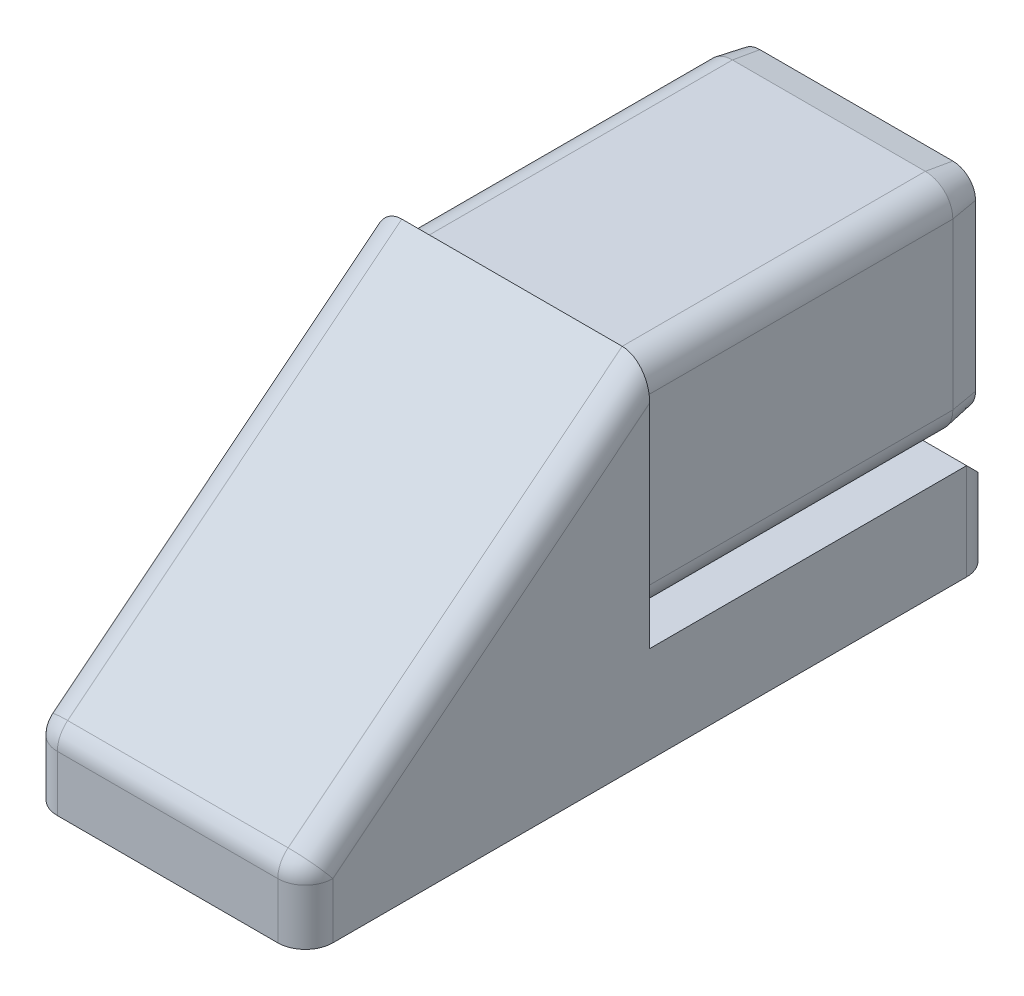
ISO-10303-21;
HEADER;
FILE_DESCRIPTION(('STEP AP214'),'2;1');
FILE_NAME('part.step','',(''),(''),'','','');
FILE_SCHEMA(('AUTOMOTIVE_DESIGN { 1 0 10303 214 1 1 1 1 }'));
ENDSEC;
DATA;
#1=APPLICATION_CONTEXT('core data for automotive mechanical design processes');
#2=APPLICATION_PROTOCOL_DEFINITION('international standard','automotive_design',2000,#1);
#3=PRODUCT_CONTEXT('',#1,'mechanical');
#4=PRODUCT('Part','Part','',(#3));
#5=PRODUCT_RELATED_PRODUCT_CATEGORY('part','',(#4));
#6=PRODUCT_DEFINITION_FORMATION('','',#4);
#7=PRODUCT_DEFINITION_CONTEXT('part definition',#1,'design');
#8=PRODUCT_DEFINITION('design','',#6,#7);
#9=PRODUCT_DEFINITION_SHAPE('','',#8);
#10=(LENGTH_UNIT() NAMED_UNIT(*) SI_UNIT(.MILLI.,.METRE.));
#11=(NAMED_UNIT(*) PLANE_ANGLE_UNIT() SI_UNIT($,.RADIAN.));
#12=(NAMED_UNIT(*) SI_UNIT($,.STERADIAN.) SOLID_ANGLE_UNIT());
#13=UNCERTAINTY_MEASURE_WITH_UNIT(LENGTH_MEASURE(1.E-05),#10,'distance_accuracy_value','');
#14=(GEOMETRIC_REPRESENTATION_CONTEXT(3) GLOBAL_UNCERTAINTY_ASSIGNED_CONTEXT((#13)) GLOBAL_UNIT_ASSIGNED_CONTEXT((#10,
#11,#12)) REPRESENTATION_CONTEXT('',''));
#15=CARTESIAN_POINT('',(0.,0.,0.));
#16=DIRECTION('',(0.,0.,1.));
#17=DIRECTION('',(1.,0.,0.));
#18=AXIS2_PLACEMENT_3D('',#15,#16,#17);
#19=CARTESIAN_POINT('',(20.,-30.,0.));
#20=DIRECTION('',(0.,0.,1.));
#21=DIRECTION('',(1.,0.,0.));
#22=AXIS2_PLACEMENT_3D('',#19,#20,#21);
#23=PLANE('',#22);
#24=DIRECTION('',(-1.,0.,0.));
#25=VECTOR('',#24,1.);
#26=CARTESIAN_POINT('',(20.,20.,0.));
#27=LINE('',#26,#25);
#28=CARTESIAN_POINT('',(16.,20.,0.));
#29=VERTEX_POINT('',#28);
#30=CARTESIAN_POINT('',(-16.,20.,0.));
#31=VERTEX_POINT('',#30);
#32=EDGE_CURVE('E419',#29,#31,#27,.T.);
#33=ORIENTED_EDGE('',*,*,#32,.F.);
#34=CARTESIAN_POINT('',(16.,14.8775006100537,0.));
#35=DIRECTION('',(0.,0.,1.));
#36=DIRECTION('',(0.,-1.,0.));
#37=AXIS2_PLACEMENT_3D('',#34,#35,#36);
#38=ELLIPSE('',#37,5.12249938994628,4.);
#39=CARTESIAN_POINT('',(20.,14.8775006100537,0.));
#40=VERTEX_POINT('',#39);
#41=EDGE_CURVE('E276',#29,#40,#38,.F.);
#42=ORIENTED_EDGE('',*,*,#41,.T.);
#43=DIRECTION('',(0.,1.,0.));
#44=VECTOR('',#43,1.);
#45=CARTESIAN_POINT('',(20.,-30.,0.));
#46=LINE('',#45,#44);
#47=CARTESIAN_POINT('',(20.,-16.,0.));
#48=VERTEX_POINT('',#47);
#49=EDGE_CURVE('E416',#48,#40,#46,.T.);
#50=ORIENTED_EDGE('',*,*,#49,.F.);
#51=CARTESIAN_POINT('',(16.,-16.,0.));
#52=DIRECTION('',(0.,0.,-1.));
#53=DIRECTION('',(1.,0.,0.));
#54=AXIS2_PLACEMENT_3D('',#51,#52,#53);
#55=CIRCLE('',#54,4.);
#56=CARTESIAN_POINT('',(16.,-20.,0.));
#57=VERTEX_POINT('',#56);
#58=EDGE_CURVE('E301',#48,#57,#55,.T.);
#59=ORIENTED_EDGE('',*,*,#58,.T.);
#60=DIRECTION('',(-1.,0.,0.));
#61=VECTOR('',#60,1.);
#62=CARTESIAN_POINT('',(16.,-20.,0.));
#63=LINE('',#62,#61);
#64=CARTESIAN_POINT('',(-16.,-20.,0.));
#65=VERTEX_POINT('',#64);
#66=EDGE_CURVE('E232',#57,#65,#63,.T.);
#67=ORIENTED_EDGE('',*,*,#66,.T.);
#68=CARTESIAN_POINT('',(-16.,-16.,0.));
#69=DIRECTION('',(0.,0.,-1.));
#70=DIRECTION('',(-1.,0.,0.));
#71=AXIS2_PLACEMENT_3D('',#68,#69,#70);
#72=CIRCLE('',#71,4.);
#73=CARTESIAN_POINT('',(-20.,-16.,0.));
#74=VERTEX_POINT('',#73);
#75=EDGE_CURVE('E244',#65,#74,#72,.T.);
#76=ORIENTED_EDGE('',*,*,#75,.T.);
#77=DIRECTION('',(0.,1.,0.));
#78=VECTOR('',#77,1.);
#79=CARTESIAN_POINT('',(-20.,-30.,0.));
#80=LINE('',#79,#78);
#81=CARTESIAN_POINT('',(-20.,14.8775006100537,0.));
#82=VERTEX_POINT('',#81);
#83=EDGE_CURVE('E426',#74,#82,#80,.T.);
#84=ORIENTED_EDGE('',*,*,#83,.T.);
#85=CARTESIAN_POINT('',(-16.,14.8775006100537,0.));
#86=DIRECTION('',(0.,0.,1.));
#87=DIRECTION('',(0.,1.,0.));
#88=AXIS2_PLACEMENT_3D('',#85,#86,#87);
#89=ELLIPSE('',#88,5.12249938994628,4.);
#90=EDGE_CURVE('E274',#82,#31,#89,.F.);
#91=ORIENTED_EDGE('',*,*,#90,.T.);
#92=EDGE_LOOP('',(#33,#42,#50,#59,#67,#76,#84,#91));
#93=FACE_BOUND('',#92,.T.);
#94=DIRECTION('',(0.,-1.,0.));
#95=VECTOR('',#94,1.);
#96=CARTESIAN_POINT('',(-18.,14.,0.));
#97=LINE('',#96,#95);
#98=CARTESIAN_POINT('',(-18.,14.,0.));
#99=VERTEX_POINT('',#98);
#100=CARTESIAN_POINT('',(-18.,-9.99999999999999,0.));
#101=VERTEX_POINT('',#100);
#102=EDGE_CURVE('E437',#99,#101,#97,.T.);
#103=ORIENTED_EDGE('',*,*,#102,.T.);
#104=CARTESIAN_POINT('',(-14.,-10.,0.));
#105=DIRECTION('',(0.,0.,1.));
#106=DIRECTION('',(1.,0.,0.));
#107=AXIS2_PLACEMENT_3D('',#104,#105,#106);
#108=CIRCLE('',#107,4.);
#109=CARTESIAN_POINT('',(-14.,-14.,0.));
#110=VERTEX_POINT('',#109);
#111=EDGE_CURVE('E278',#101,#110,#108,.T.);
#112=ORIENTED_EDGE('',*,*,#111,.T.);
#113=DIRECTION('',(1.,0.,0.));
#114=VECTOR('',#113,1.);
#115=CARTESIAN_POINT('',(18.,-14.,0.));
#116=LINE('',#115,#114);
#117=CARTESIAN_POINT('',(14.,-14.,0.));
#118=VERTEX_POINT('',#117);
#119=EDGE_CURVE('E387',#110,#118,#116,.T.);
#120=ORIENTED_EDGE('',*,*,#119,.T.);
#121=CARTESIAN_POINT('',(14.,-10.,0.));
#122=DIRECTION('',(0.,0.,1.));
#123=DIRECTION('',(1.,0.,0.));
#124=AXIS2_PLACEMENT_3D('',#121,#122,#123);
#125=CIRCLE('',#124,4.);
#126=CARTESIAN_POINT('',(18.,-9.99999999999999,0.));
#127=VERTEX_POINT('',#126);
#128=EDGE_CURVE('E280',#118,#127,#125,.T.);
#129=ORIENTED_EDGE('',*,*,#128,.T.);
#130=DIRECTION('',(0.,1.,0.));
#131=VECTOR('',#130,1.);
#132=CARTESIAN_POINT('',(18.,14.,0.));
#133=LINE('',#132,#131);
#134=CARTESIAN_POINT('',(18.,14.,0.));
#135=VERTEX_POINT('',#134);
#136=EDGE_CURVE('E461',#127,#135,#133,.T.);
#137=ORIENTED_EDGE('',*,*,#136,.T.);
#138=CARTESIAN_POINT('',(14.,14.,0.));
#139=DIRECTION('',(0.,0.,1.));
#140=DIRECTION('',(-1.,0.,0.));
#141=AXIS2_PLACEMENT_3D('',#138,#139,#140);
#142=CIRCLE('',#141,4.);
#143=CARTESIAN_POINT('',(14.,18.,0.));
#144=VERTEX_POINT('',#143);
#145=EDGE_CURVE('E457',#135,#144,#142,.T.);
#146=ORIENTED_EDGE('',*,*,#145,.T.);
#147=DIRECTION('',(-1.,0.,0.));
#148=VECTOR('',#147,1.);
#149=CARTESIAN_POINT('',(-14.,18.,0.));
#150=LINE('',#149,#148);
#151=CARTESIAN_POINT('',(-14.,18.,0.));
#152=VERTEX_POINT('',#151);
#153=EDGE_CURVE('E446',#144,#152,#150,.T.);
#154=ORIENTED_EDGE('',*,*,#153,.T.);
#155=CARTESIAN_POINT('',(-14.,14.,0.));
#156=DIRECTION('',(0.,0.,1.));
#157=DIRECTION('',(-1.,0.,0.));
#158=AXIS2_PLACEMENT_3D('',#155,#156,#157);
#159=CIRCLE('',#158,4.);
#160=EDGE_CURVE('E442',#152,#99,#159,.T.);
#161=ORIENTED_EDGE('',*,*,#160,.T.);
#162=EDGE_LOOP('',(#103,#112,#120,#129,#137,#146,#154,#161));
#163=FACE_BOUND('',#162,.T.);
#164=ADVANCED_FACE('F42',(#93,#163),#23,.F.);
#165=CARTESIAN_POINT('',(20.,20.,0.));
#166=DIRECTION('',(0.,-0.78086880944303,-0.624695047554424));
#167=DIRECTION('',(0.,0.624695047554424,-0.78086880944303));
#168=AXIS2_PLACEMENT_3D('',#165,#166,#167);
#169=PLANE('',#168);
#170=DIRECTION('',(-1.,0.,0.));
#171=VECTOR('',#170,1.);
#172=CARTESIAN_POINT('',(20.,-18.7990241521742,48.4987801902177));
#173=LINE('',#172,#171);
#174=CARTESIAN_POINT('',(-16.,-18.7990241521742,48.4987801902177));
#175=VERTEX_POINT('',#174);
#176=CARTESIAN_POINT('',(16.,-18.7990241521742,48.4987801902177));
#177=VERTEX_POINT('',#176);
#178=EDGE_CURVE('E270',#175,#177,#173,.F.);
#179=ORIENTED_EDGE('',*,*,#178,.T.);
#180=DIRECTION('',(0.,-0.624695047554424,0.78086880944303));
#181=VECTOR('',#180,1.);
#182=CARTESIAN_POINT('',(16.,20.,0.));
#183=LINE('',#182,#181);
#184=EDGE_CURVE('E272',#177,#29,#183,.F.);
#185=ORIENTED_EDGE('',*,*,#184,.T.);
#186=ORIENTED_EDGE('',*,*,#32,.T.);
#187=DIRECTION('',(0.,-0.624695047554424,0.78086880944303));
#188=VECTOR('',#187,1.);
#189=CARTESIAN_POINT('',(-16.,-20.,50.));
#190=LINE('',#189,#188);
#191=EDGE_CURVE('E268',#31,#175,#190,.T.);
#192=ORIENTED_EDGE('',*,*,#191,.T.);
#193=EDGE_LOOP('',(#179,#185,#186,#192));
#194=FACE_BOUND('',#193,.T.);
#195=ADVANCED_FACE('F508',(#194),#169,.F.);
#196=CARTESIAN_POINT('',(20.,-20.,50.));
#197=DIRECTION('',(0.,0.,-1.));
#198=DIRECTION('',(-1.,0.,0.));
#199=AXIS2_PLACEMENT_3D('',#196,#197,#198);
#200=PLANE('',#199);
#201=DIRECTION('',(-1.,0.,0.));
#202=VECTOR('',#201,1.);
#203=CARTESIAN_POINT('',(20.,-30.,50.));
#204=LINE('',#203,#202);
#205=CARTESIAN_POINT('',(16.,-30.,50.));
#206=VERTEX_POINT('',#205);
#207=CARTESIAN_POINT('',(-16.,-30.,50.));
#208=VERTEX_POINT('',#207);
#209=EDGE_CURVE('E415',#206,#208,#204,.T.);
#210=ORIENTED_EDGE('',*,*,#209,.F.);
#211=DIRECTION('',(0.,-1.,0.));
#212=VECTOR('',#211,1.);
#213=CARTESIAN_POINT('',(16.,-20.,50.));
#214=LINE('',#213,#212);
#215=CARTESIAN_POINT('',(16.,-21.9224993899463,50.));
#216=VERTEX_POINT('',#215);
#217=EDGE_CURVE('E266',#206,#216,#214,.F.);
#218=ORIENTED_EDGE('',*,*,#217,.T.);
#219=DIRECTION('',(-1.,0.,0.));
#220=VECTOR('',#219,1.);
#221=CARTESIAN_POINT('',(20.,-21.9224993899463,50.));
#222=LINE('',#221,#220);
#223=CARTESIAN_POINT('',(-16.,-21.9224993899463,50.));
#224=VERTEX_POINT('',#223);
#225=EDGE_CURVE('E264',#216,#224,#222,.T.);
#226=ORIENTED_EDGE('',*,*,#225,.T.);
#227=DIRECTION('',(0.,-1.,0.));
#228=VECTOR('',#227,1.);
#229=CARTESIAN_POINT('',(-16.,-30.,50.));
#230=LINE('',#229,#228);
#231=EDGE_CURVE('E222',#224,#208,#230,.T.);
#232=ORIENTED_EDGE('',*,*,#231,.T.);
#233=EDGE_LOOP('',(#210,#218,#226,#232));
#234=FACE_BOUND('',#233,.T.);
#235=ADVANCED_FACE('F493',(#234),#200,.F.);
#236=CARTESIAN_POINT('',(20.,-30.,50.));
#237=DIRECTION('',(0.,1.,0.));
#238=DIRECTION('',(0.,0.,1.));
#239=AXIS2_PLACEMENT_3D('',#236,#237,#238);
#240=PLANE('',#239);
#241=DIRECTION('',(0.,0.,-1.));
#242=VECTOR('',#241,1.);
#243=CARTESIAN_POINT('',(-20.,-30.,50.));
#244=LINE('',#243,#242);
#245=CARTESIAN_POINT('',(-20.,-30.,46.));
#246=VERTEX_POINT('',#245);
#247=CARTESIAN_POINT('',(-20.,-30.,-46.));
#248=VERTEX_POINT('',#247);
#249=EDGE_CURVE('E422',#246,#248,#244,.T.);
#250=ORIENTED_EDGE('',*,*,#249,.T.);
#251=CARTESIAN_POINT('',(-16.,-30.,-46.));
#252=DIRECTION('',(0.,1.,0.));
#253=DIRECTION('',(0.,0.,1.));
#254=AXIS2_PLACEMENT_3D('',#251,#252,#253);
#255=CIRCLE('',#254,4.);
#256=CARTESIAN_POINT('',(-16.,-30.,-50.));
#257=VERTEX_POINT('',#256);
#258=EDGE_CURVE('E249',#248,#257,#255,.F.);
#259=ORIENTED_EDGE('',*,*,#258,.T.);
#260=DIRECTION('',(1.,0.,0.));
#261=VECTOR('',#260,1.);
#262=CARTESIAN_POINT('',(20.,-30.,-50.));
#263=LINE('',#262,#261);
#264=CARTESIAN_POINT('',(16.,-30.,-50.));
#265=VERTEX_POINT('',#264);
#266=EDGE_CURVE('E234',#257,#265,#263,.T.);
#267=ORIENTED_EDGE('',*,*,#266,.T.);
#268=CARTESIAN_POINT('',(16.,-30.,-46.));
#269=DIRECTION('',(0.,1.,0.));
#270=DIRECTION('',(0.,0.,1.));
#271=AXIS2_PLACEMENT_3D('',#268,#269,#270);
#272=CIRCLE('',#271,4.);
#273=CARTESIAN_POINT('',(20.,-30.,-46.));
#274=VERTEX_POINT('',#273);
#275=EDGE_CURVE('E248',#265,#274,#272,.F.);
#276=ORIENTED_EDGE('',*,*,#275,.T.);
#277=DIRECTION('',(0.,0.,-1.));
#278=VECTOR('',#277,1.);
#279=CARTESIAN_POINT('',(20.,-30.,50.));
#280=LINE('',#279,#278);
#281=CARTESIAN_POINT('',(20.,-30.,46.));
#282=VERTEX_POINT('',#281);
#283=EDGE_CURVE('E411',#282,#274,#280,.T.);
#284=ORIENTED_EDGE('',*,*,#283,.F.);
#285=CARTESIAN_POINT('',(16.,-30.,46.));
#286=DIRECTION('',(0.,1.,0.));
#287=DIRECTION('',(0.,0.,1.));
#288=AXIS2_PLACEMENT_3D('',#285,#286,#287);
#289=CIRCLE('',#288,4.);
#290=EDGE_CURVE('E405',#282,#206,#289,.F.);
#291=ORIENTED_EDGE('',*,*,#290,.T.);
#292=ORIENTED_EDGE('',*,*,#209,.T.);
#293=CARTESIAN_POINT('',(-16.,-30.,46.));
#294=DIRECTION('',(0.,1.,0.));
#295=DIRECTION('',(0.,0.,1.));
#296=AXIS2_PLACEMENT_3D('',#293,#294,#295);
#297=CIRCLE('',#296,4.);
#298=EDGE_CURVE('E403',#208,#246,#297,.F.);
#299=ORIENTED_EDGE('',*,*,#298,.T.);
#300=EDGE_LOOP('',(#250,#259,#267,#276,#284,#291,#292,#299));
#301=FACE_BOUND('',#300,.T.);
#302=ADVANCED_FACE('F410',(#301),#240,.F.);
#303=CARTESIAN_POINT('',(20.,0.,0.));
#304=DIRECTION('',(-1.,0.,0.));
#305=DIRECTION('',(0.,0.,1.));
#306=AXIS2_PLACEMENT_3D('',#303,#304,#305);
#307=PLANE('',#306);
#308=ORIENTED_EDGE('',*,*,#283,.T.);
#309=DIRECTION('',(0.,1.,0.));
#310=VECTOR('',#309,1.);
#311=CARTESIAN_POINT('',(20.,0.,-46.));
#312=LINE('',#311,#310);
#313=CARTESIAN_POINT('',(20.,-16.,-46.));
#314=VERTEX_POINT('',#313);
#315=EDGE_CURVE('E223',#274,#314,#312,.T.);
#316=ORIENTED_EDGE('',*,*,#315,.T.);
#317=DIRECTION('',(0.,0.,1.));
#318=VECTOR('',#317,1.);
#319=CARTESIAN_POINT('',(20.,-16.,-50.));
#320=LINE('',#319,#318);
#321=EDGE_CURVE('E217',#314,#48,#320,.T.);
#322=ORIENTED_EDGE('',*,*,#321,.T.);
#323=ORIENTED_EDGE('',*,*,#49,.T.);
#324=DIRECTION('',(0.,-0.624695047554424,0.78086880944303));
#325=VECTOR('',#324,1.);
#326=CARTESIAN_POINT('',(20.,9.0716467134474,7.25731737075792));
#327=LINE('',#326,#325);
#328=CARTESIAN_POINT('',(20.,-21.9224993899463,46.));
#329=VERTEX_POINT('',#328);
#330=EDGE_CURVE('E257',#40,#329,#327,.T.);
#331=ORIENTED_EDGE('',*,*,#330,.T.);
#332=DIRECTION('',(0.,-1.,0.));
#333=VECTOR('',#332,1.);
#334=CARTESIAN_POINT('',(20.,0.,46.));
#335=LINE('',#334,#333);
#336=EDGE_CURVE('E259',#329,#282,#335,.T.);
#337=ORIENTED_EDGE('',*,*,#336,.T.);
#338=EDGE_LOOP('',(#308,#316,#322,#323,#331,#337));
#339=FACE_BOUND('',#338,.T.);
#340=ADVANCED_FACE('F413',(#339),#307,.F.);
#341=CARTESIAN_POINT('',(-20.,0.,0.));
#342=DIRECTION('',(-1.,0.,0.));
#343=DIRECTION('',(0.,0.,1.));
#344=AXIS2_PLACEMENT_3D('',#341,#342,#343);
#345=PLANE('',#344);
#346=DIRECTION('',(0.,0.,1.));
#347=VECTOR('',#346,1.);
#348=CARTESIAN_POINT('',(-20.,-16.,-50.));
#349=LINE('',#348,#347);
#350=CARTESIAN_POINT('',(-20.,-16.,-46.));
#351=VERTEX_POINT('',#350);
#352=EDGE_CURVE('E467',#351,#74,#349,.T.);
#353=ORIENTED_EDGE('',*,*,#352,.F.);
#354=DIRECTION('',(0.,-1.,0.));
#355=VECTOR('',#354,1.);
#356=CARTESIAN_POINT('',(-20.,-30.,-46.));
#357=LINE('',#356,#355);
#358=EDGE_CURVE('E400',#351,#248,#357,.T.);
#359=ORIENTED_EDGE('',*,*,#358,.T.);
#360=ORIENTED_EDGE('',*,*,#249,.F.);
#361=DIRECTION('',(0.,-1.,0.));
#362=VECTOR('',#361,1.);
#363=CARTESIAN_POINT('',(-20.,-20.,46.));
#364=LINE('',#363,#362);
#365=CARTESIAN_POINT('',(-20.,-21.9224993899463,46.));
#366=VERTEX_POINT('',#365);
#367=EDGE_CURVE('E398',#246,#366,#364,.F.);
#368=ORIENTED_EDGE('',*,*,#367,.T.);
#369=DIRECTION('',(0.,-0.624695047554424,0.78086880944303));
#370=VECTOR('',#369,1.);
#371=CARTESIAN_POINT('',(-20.,16.8765247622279,-2.4987801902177));
#372=LINE('',#371,#370);
#373=EDGE_CURVE('E392',#366,#82,#372,.F.);
#374=ORIENTED_EDGE('',*,*,#373,.T.);
#375=ORIENTED_EDGE('',*,*,#83,.F.);
#376=EDGE_LOOP('',(#353,#359,#360,#368,#374,#375));
#377=FACE_BOUND('',#376,.T.);
#378=ADVANCED_FACE('F517',(#377),#345,.T.);
#379=CARTESIAN_POINT('',(18.,-14.,-50.));
#380=DIRECTION('',(0.,-1.,0.));
#381=DIRECTION('',(0.,0.,-1.));
#382=AXIS2_PLACEMENT_3D('',#379,#380,#381);
#383=PLANE('',#382);
#384=DIRECTION('',(0.,0.,1.));
#385=VECTOR('',#384,1.);
#386=CARTESIAN_POINT('',(-14.,-14.,-50.));
#387=LINE('',#386,#385);
#388=CARTESIAN_POINT('',(-14.,-14.,-45.9999999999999));
#389=VERTEX_POINT('',#388);
#390=EDGE_CURVE('E380',#110,#389,#387,.F.);
#391=ORIENTED_EDGE('',*,*,#390,.T.);
#392=DIRECTION('',(1.,0.,0.));
#393=VECTOR('',#392,1.);
#394=CARTESIAN_POINT('',(18.,-14.,-45.9999999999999));
#395=LINE('',#394,#393);
#396=CARTESIAN_POINT('',(14.,-14.,-45.9999999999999));
#397=VERTEX_POINT('',#396);
#398=EDGE_CURVE('E282',#389,#397,#395,.T.);
#399=ORIENTED_EDGE('',*,*,#398,.T.);
#400=DIRECTION('',(0.,0.,1.));
#401=VECTOR('',#400,1.);
#402=CARTESIAN_POINT('',(14.,-14.,-50.));
#403=LINE('',#402,#401);
#404=EDGE_CURVE('E389',#397,#118,#403,.T.);
#405=ORIENTED_EDGE('',*,*,#404,.T.);
#406=ORIENTED_EDGE('',*,*,#119,.F.);
#407=EDGE_LOOP('',(#391,#399,#405,#406));
#408=FACE_BOUND('',#407,.T.);
#409=ADVANCED_FACE('F384',(#408),#383,.T.);
#410=CARTESIAN_POINT('',(-18.,14.,-50.));
#411=DIRECTION('',(-1.,0.,0.));
#412=DIRECTION('',(0.,0.,1.));
#413=AXIS2_PLACEMENT_3D('',#410,#411,#412);
#414=PLANE('',#413);
#415=DIRECTION('',(0.,0.,1.));
#416=VECTOR('',#415,1.);
#417=CARTESIAN_POINT('',(-18.,14.,-50.));
#418=LINE('',#417,#416);
#419=CARTESIAN_POINT('',(-18.,14.,-45.9999999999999));
#420=VERTEX_POINT('',#419);
#421=EDGE_CURVE('E429',#420,#99,#418,.T.);
#422=ORIENTED_EDGE('',*,*,#421,.F.);
#423=DIRECTION('',(0.,-1.,0.));
#424=VECTOR('',#423,1.);
#425=CARTESIAN_POINT('',(-18.,14.,-45.9999999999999));
#426=LINE('',#425,#424);
#427=CARTESIAN_POINT('',(-18.,-10.,-45.9999999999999));
#428=VERTEX_POINT('',#427);
#429=EDGE_CURVE('E327',#420,#428,#426,.T.);
#430=ORIENTED_EDGE('',*,*,#429,.T.);
#431=DIRECTION('',(0.,0.,1.));
#432=VECTOR('',#431,1.);
#433=CARTESIAN_POINT('',(-18.,-10.,-50.));
#434=LINE('',#433,#432);
#435=EDGE_CURVE('E381',#428,#101,#434,.T.);
#436=ORIENTED_EDGE('',*,*,#435,.T.);
#437=ORIENTED_EDGE('',*,*,#102,.F.);
#438=EDGE_LOOP('',(#422,#430,#436,#437));
#439=FACE_BOUND('',#438,.T.);
#440=ADVANCED_FACE('F435',(#439),#414,.T.);
#441=CARTESIAN_POINT('',(-14.,14.,-50.));
#442=DIRECTION('',(0.,0.,1.));
#443=DIRECTION('',(1.,0.,0.));
#444=AXIS2_PLACEMENT_3D('',#441,#442,#443);
#445=CYLINDRICAL_SURFACE('',#444,4.);
#446=DIRECTION('',(0.,0.,1.));
#447=VECTOR('',#446,1.);
#448=CARTESIAN_POINT('',(-14.,18.,-50.));
#449=LINE('',#448,#447);
#450=CARTESIAN_POINT('',(-14.,18.,-45.9999999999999));
#451=VERTEX_POINT('',#450);
#452=EDGE_CURVE('E451',#451,#152,#449,.T.);
#453=ORIENTED_EDGE('',*,*,#452,.F.);
#454=CARTESIAN_POINT('',(-14.,14.,-45.9999999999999));
#455=DIRECTION('',(0.,0.,-1.));
#456=DIRECTION('',(-1.,0.,0.));
#457=AXIS2_PLACEMENT_3D('',#454,#455,#456);
#458=CIRCLE('',#457,4.);
#459=EDGE_CURVE('E52',#451,#420,#458,.F.);
#460=ORIENTED_EDGE('',*,*,#459,.T.);
#461=ORIENTED_EDGE('',*,*,#421,.T.);
#462=ORIENTED_EDGE('',*,*,#160,.F.);
#463=EDGE_LOOP('',(#453,#460,#461,#462));
#464=FACE_BOUND('',#463,.T.);
#465=ADVANCED_FACE('F563',(#464),#445,.T.);
#466=CARTESIAN_POINT('',(-14.,18.,-50.));
#467=DIRECTION('',(0.,1.,0.));
#468=DIRECTION('',(0.,0.,1.));
#469=AXIS2_PLACEMENT_3D('',#466,#467,#468);
#470=PLANE('',#469);
#471=DIRECTION('',(0.,0.,1.));
#472=VECTOR('',#471,1.);
#473=CARTESIAN_POINT('',(14.,18.,-50.));
#474=LINE('',#473,#472);
#475=CARTESIAN_POINT('',(14.,18.,-45.9999999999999));
#476=VERTEX_POINT('',#475);
#477=EDGE_CURVE('E445',#476,#144,#474,.T.);
#478=ORIENTED_EDGE('',*,*,#477,.F.);
#479=DIRECTION('',(-1.,0.,0.));
#480=VECTOR('',#479,1.);
#481=CARTESIAN_POINT('',(-14.,18.,-45.9999999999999));
#482=LINE('',#481,#480);
#483=EDGE_CURVE('E11',#476,#451,#482,.T.);
#484=ORIENTED_EDGE('',*,*,#483,.T.);
#485=ORIENTED_EDGE('',*,*,#452,.T.);
#486=ORIENTED_EDGE('',*,*,#153,.F.);
#487=EDGE_LOOP('',(#478,#484,#485,#486));
#488=FACE_BOUND('',#487,.T.);
#489=ADVANCED_FACE('F458',(#488),#470,.T.);
#490=CARTESIAN_POINT('',(14.,14.,-50.));
#491=DIRECTION('',(0.,0.,1.));
#492=DIRECTION('',(1.,0.,0.));
#493=AXIS2_PLACEMENT_3D('',#490,#491,#492);
#494=CYLINDRICAL_SURFACE('',#493,4.);
#495=DIRECTION('',(0.,0.,1.));
#496=VECTOR('',#495,1.);
#497=CARTESIAN_POINT('',(18.,14.,-50.));
#498=LINE('',#497,#496);
#499=CARTESIAN_POINT('',(18.,14.,-45.9999999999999));
#500=VERTEX_POINT('',#499);
#501=EDGE_CURVE('E443',#500,#135,#498,.T.);
#502=ORIENTED_EDGE('',*,*,#501,.F.);
#503=CARTESIAN_POINT('',(14.,14.,-45.9999999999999));
#504=DIRECTION('',(0.,0.,-1.));
#505=DIRECTION('',(-1.,0.,0.));
#506=AXIS2_PLACEMENT_3D('',#503,#504,#505);
#507=CIRCLE('',#506,4.);
#508=EDGE_CURVE('E66',#500,#476,#507,.F.);
#509=ORIENTED_EDGE('',*,*,#508,.T.);
#510=ORIENTED_EDGE('',*,*,#477,.T.);
#511=ORIENTED_EDGE('',*,*,#145,.F.);
#512=EDGE_LOOP('',(#502,#509,#510,#511));
#513=FACE_BOUND('',#512,.T.);
#514=ADVANCED_FACE('F455',(#513),#494,.T.);
#515=CARTESIAN_POINT('',(18.,14.,-50.));
#516=DIRECTION('',(1.,0.,0.));
#517=DIRECTION('',(0.,0.,-1.));
#518=AXIS2_PLACEMENT_3D('',#515,#516,#517);
#519=PLANE('',#518);
#520=DIRECTION('',(0.,0.,1.));
#521=VECTOR('',#520,1.);
#522=CARTESIAN_POINT('',(18.,-10.,-50.));
#523=LINE('',#522,#521);
#524=CARTESIAN_POINT('',(18.,-10.,-45.9999999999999));
#525=VERTEX_POINT('',#524);
#526=EDGE_CURVE('E388',#127,#525,#523,.F.);
#527=ORIENTED_EDGE('',*,*,#526,.T.);
#528=DIRECTION('',(0.,1.,0.));
#529=VECTOR('',#528,1.);
#530=CARTESIAN_POINT('',(18.,14.,-45.9999999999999));
#531=LINE('',#530,#529);
#532=EDGE_CURVE('E325',#525,#500,#531,.T.);
#533=ORIENTED_EDGE('',*,*,#532,.T.);
#534=ORIENTED_EDGE('',*,*,#501,.T.);
#535=ORIENTED_EDGE('',*,*,#136,.F.);
#536=EDGE_LOOP('',(#527,#533,#534,#535));
#537=FACE_BOUND('',#536,.T.);
#538=ADVANCED_FACE('F560',(#537),#519,.T.);
#539=CARTESIAN_POINT('',(-14.,14.,-50.));
#540=DIRECTION('',(0.,0.,-1.));
#541=DIRECTION('',(-1.,0.,0.));
#542=AXIS2_PLACEMENT_3D('',#539,#540,#541);
#543=PLANE('',#542);
#544=CARTESIAN_POINT('',(14.,-10.,-50.));
#545=DIRECTION('',(0.,0.,-1.));
#546=DIRECTION('',(-1.,0.,0.));
#547=AXIS2_PLACEMENT_3D('',#544,#545,#546);
#548=CIRCLE('',#547,3.29469207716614);
#549=CARTESIAN_POINT('',(17.2946920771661,-10.,-50.));
#550=VERTEX_POINT('',#549);
#551=CARTESIAN_POINT('',(14.,-13.2946920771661,-50.));
#552=VERTEX_POINT('',#551);
#553=EDGE_CURVE('E316',#550,#552,#548,.T.);
#554=ORIENTED_EDGE('',*,*,#553,.T.);
#555=DIRECTION('',(-1.,0.,0.));
#556=VECTOR('',#555,1.);
#557=CARTESIAN_POINT('',(-14.,-13.2946920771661,-50.));
#558=LINE('',#557,#556);
#559=CARTESIAN_POINT('',(-14.,-13.2946920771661,-50.));
#560=VERTEX_POINT('',#559);
#561=EDGE_CURVE('E318',#552,#560,#558,.T.);
#562=ORIENTED_EDGE('',*,*,#561,.T.);
#563=CARTESIAN_POINT('',(-14.,-10.,-50.));
#564=DIRECTION('',(0.,0.,-1.));
#565=DIRECTION('',(-1.,0.,0.));
#566=AXIS2_PLACEMENT_3D('',#563,#564,#565);
#567=CIRCLE('',#566,3.29469207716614);
#568=CARTESIAN_POINT('',(-17.2946920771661,-10.,-50.));
#569=VERTEX_POINT('',#568);
#570=EDGE_CURVE('E314',#560,#569,#567,.T.);
#571=ORIENTED_EDGE('',*,*,#570,.T.);
#572=DIRECTION('',(0.,1.,0.));
#573=VECTOR('',#572,1.);
#574=CARTESIAN_POINT('',(-17.2946920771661,14.,-50.));
#575=LINE('',#574,#573);
#576=CARTESIAN_POINT('',(-17.2946920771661,14.,-50.));
#577=VERTEX_POINT('',#576);
#578=EDGE_CURVE('E310',#569,#577,#575,.T.);
#579=ORIENTED_EDGE('',*,*,#578,.T.);
#580=CARTESIAN_POINT('',(-14.,14.,-50.));
#581=DIRECTION('',(0.,0.,-1.));
#582=DIRECTION('',(-1.,0.,0.));
#583=AXIS2_PLACEMENT_3D('',#580,#581,#582);
#584=CIRCLE('',#583,3.29469207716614);
#585=CARTESIAN_POINT('',(-14.,17.2946920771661,-50.));
#586=VERTEX_POINT('',#585);
#587=EDGE_CURVE('E306',#577,#586,#584,.T.);
#588=ORIENTED_EDGE('',*,*,#587,.T.);
#589=DIRECTION('',(1.,0.,0.));
#590=VECTOR('',#589,1.);
#591=CARTESIAN_POINT('',(-14.,17.2946920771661,-50.));
#592=LINE('',#591,#590);
#593=CARTESIAN_POINT('',(14.,17.2946920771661,-50.));
#594=VERTEX_POINT('',#593);
#595=EDGE_CURVE('E304',#586,#594,#592,.T.);
#596=ORIENTED_EDGE('',*,*,#595,.T.);
#597=CARTESIAN_POINT('',(14.,14.,-50.));
#598=DIRECTION('',(0.,0.,-1.));
#599=DIRECTION('',(-1.,0.,0.));
#600=AXIS2_PLACEMENT_3D('',#597,#598,#599);
#601=CIRCLE('',#600,3.29469207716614);
#602=CARTESIAN_POINT('',(17.2946920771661,14.,-50.));
#603=VERTEX_POINT('',#602);
#604=EDGE_CURVE('E308',#594,#603,#601,.T.);
#605=ORIENTED_EDGE('',*,*,#604,.T.);
#606=DIRECTION('',(0.,-1.,0.));
#607=VECTOR('',#606,1.);
#608=CARTESIAN_POINT('',(17.2946920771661,14.,-50.));
#609=LINE('',#608,#607);
#610=EDGE_CURVE('E312',#603,#550,#609,.T.);
#611=ORIENTED_EDGE('',*,*,#610,.T.);
#612=EDGE_LOOP('',(#554,#562,#571,#579,#588,#596,#605,#611));
#613=FACE_BOUND('',#612,.T.);
#614=ADVANCED_FACE('F361',(#613),#543,.T.);
#615=CARTESIAN_POINT('',(16.,-16.,-50.));
#616=DIRECTION('',(0.,0.,1.));
#617=DIRECTION('',(1.,0.,0.));
#618=AXIS2_PLACEMENT_3D('',#615,#616,#617);
#619=CYLINDRICAL_SURFACE('',#618,4.);
#620=ORIENTED_EDGE('',*,*,#321,.F.);
#621=CARTESIAN_POINT('',(16.,-16.,-46.));
#622=DIRECTION('',(0.,-0.707106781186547,0.707106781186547));
#623=DIRECTION('',(0.,0.707106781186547,0.707106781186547));
#624=AXIS2_PLACEMENT_3D('',#621,#622,#623);
#625=ELLIPSE('',#624,5.65685424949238,4.);
#626=CARTESIAN_POINT('',(16.,-20.,-50.));
#627=VERTEX_POINT('',#626);
#628=EDGE_CURVE('E211',#314,#627,#625,.F.);
#629=ORIENTED_EDGE('',*,*,#628,.T.);
#630=DIRECTION('',(0.,0.,1.));
#631=VECTOR('',#630,1.);
#632=CARTESIAN_POINT('',(16.,-20.,-50.));
#633=LINE('',#632,#631);
#634=EDGE_CURVE('E215',#627,#57,#633,.T.);
#635=ORIENTED_EDGE('',*,*,#634,.T.);
#636=ORIENTED_EDGE('',*,*,#58,.F.);
#637=EDGE_LOOP('',(#620,#629,#635,#636));
#638=FACE_BOUND('',#637,.T.);
#639=ADVANCED_FACE('F213',(#638),#619,.F.);
#640=CARTESIAN_POINT('',(-16.,-16.,-50.));
#641=DIRECTION('',(0.,0.,1.));
#642=DIRECTION('',(1.,0.,0.));
#643=AXIS2_PLACEMENT_3D('',#640,#641,#642);
#644=CYLINDRICAL_SURFACE('',#643,4.);
#645=DIRECTION('',(0.,0.,1.));
#646=VECTOR('',#645,1.);
#647=CARTESIAN_POINT('',(-16.,-20.,-50.));
#648=LINE('',#647,#646);
#649=CARTESIAN_POINT('',(-16.,-20.,-50.));
#650=VERTEX_POINT('',#649);
#651=EDGE_CURVE('E233',#650,#65,#648,.T.);
#652=ORIENTED_EDGE('',*,*,#651,.F.);
#653=CARTESIAN_POINT('',(-16.,-16.,-46.));
#654=DIRECTION('',(0.,-0.707106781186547,0.707106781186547));
#655=DIRECTION('',(0.,0.707106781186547,0.707106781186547));
#656=AXIS2_PLACEMENT_3D('',#653,#654,#655);
#657=ELLIPSE('',#656,5.65685424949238,4.);
#658=EDGE_CURVE('E251',#650,#351,#657,.F.);
#659=ORIENTED_EDGE('',*,*,#658,.T.);
#660=ORIENTED_EDGE('',*,*,#352,.T.);
#661=ORIENTED_EDGE('',*,*,#75,.F.);
#662=EDGE_LOOP('',(#652,#659,#660,#661));
#663=FACE_BOUND('',#662,.T.);
#664=ADVANCED_FACE('F521',(#663),#644,.F.);
#665=CARTESIAN_POINT('',(16.,-20.,-50.));
#666=DIRECTION('',(0.,1.,0.));
#667=DIRECTION('',(0.,0.,1.));
#668=AXIS2_PLACEMENT_3D('',#665,#666,#667);
#669=PLANE('',#668);
#670=ORIENTED_EDGE('',*,*,#66,.F.);
#671=ORIENTED_EDGE('',*,*,#634,.F.);
#672=DIRECTION('',(-1.,0.,0.));
#673=VECTOR('',#672,1.);
#674=CARTESIAN_POINT('',(16.,-20.,-50.));
#675=LINE('',#674,#673);
#676=EDGE_CURVE('E230',#627,#650,#675,.T.);
#677=ORIENTED_EDGE('',*,*,#676,.T.);
#678=ORIENTED_EDGE('',*,*,#651,.T.);
#679=EDGE_LOOP('',(#670,#671,#677,#678));
#680=FACE_BOUND('',#679,.T.);
#681=ADVANCED_FACE('F228',(#680),#669,.T.);
#682=CARTESIAN_POINT('',(16.,-16.,-50.));
#683=DIRECTION('',(0.,0.,1.));
#684=DIRECTION('',(1.,0.,0.));
#685=AXIS2_PLACEMENT_3D('',#682,#683,#684);
#686=PLANE('',#685);
#687=ORIENTED_EDGE('',*,*,#266,.F.);
#688=DIRECTION('',(0.,-1.,0.));
#689=VECTOR('',#688,1.);
#690=CARTESIAN_POINT('',(-16.,-16.,-50.));
#691=LINE('',#690,#689);
#692=EDGE_CURVE('E242',#257,#650,#691,.F.);
#693=ORIENTED_EDGE('',*,*,#692,.T.);
#694=ORIENTED_EDGE('',*,*,#676,.F.);
#695=DIRECTION('',(0.,1.,0.));
#696=VECTOR('',#695,1.);
#697=CARTESIAN_POINT('',(16.,-16.,-50.));
#698=LINE('',#697,#696);
#699=EDGE_CURVE('E239',#627,#265,#698,.F.);
#700=ORIENTED_EDGE('',*,*,#699,.T.);
#701=EDGE_LOOP('',(#687,#693,#694,#700));
#702=FACE_BOUND('',#701,.T.);
#703=ADVANCED_FACE('F238',(#702),#686,.F.);
#704=CARTESIAN_POINT('',(-14.,-10.,-50.));
#705=DIRECTION('',(0.,0.,1.));
#706=DIRECTION('',(1.,0.,0.));
#707=AXIS2_PLACEMENT_3D('',#704,#705,#706);
#708=CYLINDRICAL_SURFACE('',#707,4.);
#709=ORIENTED_EDGE('',*,*,#435,.F.);
#710=CARTESIAN_POINT('',(-14.,-10.,-45.9999999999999));
#711=DIRECTION('',(0.,0.,-1.));
#712=DIRECTION('',(-1.,0.,0.));
#713=AXIS2_PLACEMENT_3D('',#710,#711,#712);
#714=CIRCLE('',#713,4.);
#715=EDGE_CURVE('E323',#428,#389,#714,.F.);
#716=ORIENTED_EDGE('',*,*,#715,.T.);
#717=ORIENTED_EDGE('',*,*,#390,.F.);
#718=ORIENTED_EDGE('',*,*,#111,.F.);
#719=EDGE_LOOP('',(#709,#716,#717,#718));
#720=FACE_BOUND('',#719,.T.);
#721=ADVANCED_FACE('F378',(#720),#708,.T.);
#722=CARTESIAN_POINT('',(14.,-10.,-50.));
#723=DIRECTION('',(0.,0.,1.));
#724=DIRECTION('',(1.,0.,0.));
#725=AXIS2_PLACEMENT_3D('',#722,#723,#724);
#726=CYLINDRICAL_SURFACE('',#725,4.);
#727=ORIENTED_EDGE('',*,*,#404,.F.);
#728=CARTESIAN_POINT('',(14.,-10.,-45.9999999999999));
#729=DIRECTION('',(0.,0.,-1.));
#730=DIRECTION('',(-1.,0.,0.));
#731=AXIS2_PLACEMENT_3D('',#728,#729,#730);
#732=CIRCLE('',#731,4.);
#733=EDGE_CURVE('E321',#397,#525,#732,.F.);
#734=ORIENTED_EDGE('',*,*,#733,.T.);
#735=ORIENTED_EDGE('',*,*,#526,.F.);
#736=ORIENTED_EDGE('',*,*,#128,.F.);
#737=EDGE_LOOP('',(#727,#734,#735,#736));
#738=FACE_BOUND('',#737,.T.);
#739=ADVANCED_FACE('F526',(#738),#726,.T.);
#740=CARTESIAN_POINT('',(-16.,0.,-46.));
#741=DIRECTION('',(0.,1.,0.));
#742=DIRECTION('',(0.,0.,1.));
#743=AXIS2_PLACEMENT_3D('',#740,#741,#742);
#744=CYLINDRICAL_SURFACE('',#743,4.);
#745=ORIENTED_EDGE('',*,*,#658,.F.);
#746=ORIENTED_EDGE('',*,*,#692,.F.);
#747=ORIENTED_EDGE('',*,*,#258,.F.);
#748=ORIENTED_EDGE('',*,*,#358,.F.);
#749=EDGE_LOOP('',(#745,#746,#747,#748));
#750=FACE_BOUND('',#749,.T.);
#751=ADVANCED_FACE('F524',(#750),#744,.T.);
#752=CARTESIAN_POINT('',(16.,0.,-46.));
#753=DIRECTION('',(0.,1.,0.));
#754=DIRECTION('',(0.,0.,1.));
#755=AXIS2_PLACEMENT_3D('',#752,#753,#754);
#756=CYLINDRICAL_SURFACE('',#755,4.);
#757=ORIENTED_EDGE('',*,*,#275,.F.);
#758=ORIENTED_EDGE('',*,*,#699,.F.);
#759=ORIENTED_EDGE('',*,*,#628,.F.);
#760=ORIENTED_EDGE('',*,*,#315,.F.);
#761=EDGE_LOOP('',(#757,#758,#759,#760));
#762=FACE_BOUND('',#761,.T.);
#763=ADVANCED_FACE('F247',(#762),#756,.T.);
#764=CARTESIAN_POINT('',(-16.,-20.,46.));
#765=DIRECTION('',(0.,1.,0.));
#766=DIRECTION('',(0.,0.,1.));
#767=AXIS2_PLACEMENT_3D('',#764,#765,#766);
#768=CYLINDRICAL_SURFACE('',#767,4.);
#769=ORIENTED_EDGE('',*,*,#298,.F.);
#770=ORIENTED_EDGE('',*,*,#231,.F.);
#771=CARTESIAN_POINT('',(-16.,-21.9224993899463,46.));
#772=DIRECTION('',(0.,1.,0.));
#773=DIRECTION('',(0.,0.,1.));
#774=AXIS2_PLACEMENT_3D('',#771,#772,#773);
#775=CIRCLE('',#774,4.);
#776=EDGE_CURVE('E298',#366,#224,#775,.T.);
#777=ORIENTED_EDGE('',*,*,#776,.F.);
#778=ORIENTED_EDGE('',*,*,#367,.F.);
#779=EDGE_LOOP('',(#769,#770,#777,#778));
#780=FACE_BOUND('',#779,.T.);
#781=ADVANCED_FACE('F498',(#780),#768,.T.);
#782=CARTESIAN_POINT('',(-16.,16.8765247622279,-2.4987801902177));
#783=DIRECTION('',(0.,0.624695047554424,-0.78086880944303));
#784=DIRECTION('',(0.,0.78086880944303,0.624695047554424));
#785=AXIS2_PLACEMENT_3D('',#782,#783,#784);
#786=CYLINDRICAL_SURFACE('',#785,4.);
#787=ORIENTED_EDGE('',*,*,#90,.F.);
#788=ORIENTED_EDGE('',*,*,#373,.F.);
#789=CARTESIAN_POINT('',(-16.,-21.9224993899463,46.));
#790=DIRECTION('',(0.,-0.624695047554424,0.780868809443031));
#791=DIRECTION('',(0.,-0.780868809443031,-0.624695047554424));
#792=AXIS2_PLACEMENT_3D('',#789,#790,#791);
#793=CIRCLE('',#792,4.);
#794=EDGE_CURVE('E295',#175,#366,#793,.T.);
#795=ORIENTED_EDGE('',*,*,#794,.F.);
#796=ORIENTED_EDGE('',*,*,#191,.F.);
#797=EDGE_LOOP('',(#787,#788,#795,#796));
#798=FACE_BOUND('',#797,.T.);
#799=ADVANCED_FACE('F513',(#798),#786,.T.);
#800=CARTESIAN_POINT('',(-16.,-21.9224993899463,46.));
#801=DIRECTION('',(-1.,0.,0.));
#802=DIRECTION('',(0.,-1.,0.));
#803=AXIS2_PLACEMENT_3D('',#800,#801,#802);
#804=SPHERICAL_SURFACE('',#803,4.);
#805=ORIENTED_EDGE('',*,*,#794,.T.);
#806=ORIENTED_EDGE('',*,*,#776,.T.);
#807=CARTESIAN_POINT('',(-16.,-21.9224993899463,46.));
#808=DIRECTION('',(-1.,0.,0.));
#809=DIRECTION('',(0.,0.,1.));
#810=AXIS2_PLACEMENT_3D('',#807,#808,#809);
#811=CIRCLE('',#810,4.);
#812=EDGE_CURVE('E292',#175,#224,#811,.F.);
#813=ORIENTED_EDGE('',*,*,#812,.F.);
#814=EDGE_LOOP('',(#805,#806,#813));
#815=FACE_BOUND('',#814,.T.);
#816=ADVANCED_FACE('F502',(#815),#804,.T.);
#817=CARTESIAN_POINT('',(20.,-21.9224993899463,46.));
#818=DIRECTION('',(-1.,0.,0.));
#819=DIRECTION('',(0.,0.,1.));
#820=AXIS2_PLACEMENT_3D('',#817,#818,#819);
#821=CYLINDRICAL_SURFACE('',#820,4.);
#822=ORIENTED_EDGE('',*,*,#812,.T.);
#823=ORIENTED_EDGE('',*,*,#225,.F.);
#824=CARTESIAN_POINT('',(16.,-21.9224993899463,46.));
#825=DIRECTION('',(1.,0.,0.));
#826=DIRECTION('',(0.,0.,-1.));
#827=AXIS2_PLACEMENT_3D('',#824,#825,#826);
#828=CIRCLE('',#827,4.);
#829=EDGE_CURVE('E289',#177,#216,#828,.T.);
#830=ORIENTED_EDGE('',*,*,#829,.F.);
#831=ORIENTED_EDGE('',*,*,#178,.F.);
#832=EDGE_LOOP('',(#822,#823,#830,#831));
#833=FACE_BOUND('',#832,.T.);
#834=ADVANCED_FACE('F506',(#833),#821,.T.);
#835=CARTESIAN_POINT('',(16.,9.07164671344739,7.25731737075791));
#836=DIRECTION('',(0.,-0.624695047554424,0.78086880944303));
#837=DIRECTION('',(0.,-0.78086880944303,-0.624695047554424));
#838=AXIS2_PLACEMENT_3D('',#835,#836,#837);
#839=CYLINDRICAL_SURFACE('',#838,4.);
#840=ORIENTED_EDGE('',*,*,#41,.F.);
#841=ORIENTED_EDGE('',*,*,#184,.F.);
#842=CARTESIAN_POINT('',(16.,-21.9224993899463,46.));
#843=DIRECTION('',(0.,-0.624695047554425,0.78086880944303));
#844=DIRECTION('',(0.,-0.78086880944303,-0.624695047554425));
#845=AXIS2_PLACEMENT_3D('',#842,#843,#844);
#846=CIRCLE('',#845,4.);
#847=EDGE_CURVE('E286',#329,#177,#846,.T.);
#848=ORIENTED_EDGE('',*,*,#847,.F.);
#849=ORIENTED_EDGE('',*,*,#330,.F.);
#850=EDGE_LOOP('',(#840,#841,#848,#849));
#851=FACE_BOUND('',#850,.T.);
#852=ADVANCED_FACE('F481',(#851),#839,.T.);
#853=CARTESIAN_POINT('',(16.,-21.9224993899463,46.));
#854=DIRECTION('',(1.,0.,0.));
#855=DIRECTION('',(0.,1.,0.));
#856=AXIS2_PLACEMENT_3D('',#853,#854,#855);
#857=SPHERICAL_SURFACE('',#856,4.);
#858=ORIENTED_EDGE('',*,*,#847,.T.);
#859=ORIENTED_EDGE('',*,*,#829,.T.);
#860=CARTESIAN_POINT('',(16.,-21.9224993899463,46.));
#861=DIRECTION('',(0.,1.,0.));
#862=DIRECTION('',(-1.,0.,0.));
#863=AXIS2_PLACEMENT_3D('',#860,#861,#862);
#864=CIRCLE('',#863,4.);
#865=EDGE_CURVE('E283',#329,#216,#864,.F.);
#866=ORIENTED_EDGE('',*,*,#865,.F.);
#867=EDGE_LOOP('',(#858,#859,#866));
#868=FACE_BOUND('',#867,.T.);
#869=ADVANCED_FACE('F486',(#868),#857,.T.);
#870=CARTESIAN_POINT('',(16.,0.,46.));
#871=DIRECTION('',(0.,-1.,0.));
#872=DIRECTION('',(0.,0.,-1.));
#873=AXIS2_PLACEMENT_3D('',#870,#871,#872);
#874=CYLINDRICAL_SURFACE('',#873,4.);
#875=ORIENTED_EDGE('',*,*,#865,.T.);
#876=ORIENTED_EDGE('',*,*,#217,.F.);
#877=ORIENTED_EDGE('',*,*,#290,.F.);
#878=ORIENTED_EDGE('',*,*,#336,.F.);
#879=EDGE_LOOP('',(#875,#876,#877,#878));
#880=FACE_BOUND('',#879,.T.);
#881=ADVANCED_FACE('F489',(#880),#874,.T.);
#882=CARTESIAN_POINT('',(-14.,18.,-45.9999999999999));
#883=DIRECTION('',(0.,-0.984807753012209,0.173648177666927));
#884=DIRECTION('',(-1.,0.,0.));
#885=AXIS2_PLACEMENT_3D('',#882,#883,#884);
#886=PLANE('',#885);
#887=DIRECTION('',(0.,0.173648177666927,0.984807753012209));
#888=VECTOR('',#887,1.);
#889=CARTESIAN_POINT('',(14.,17.2946920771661,-50.));
#890=LINE('',#889,#888);
#891=EDGE_CURVE('E346',#594,#476,#890,.T.);
#892=ORIENTED_EDGE('',*,*,#891,.F.);
#893=ORIENTED_EDGE('',*,*,#595,.F.);
#894=DIRECTION('',(0.,-0.173648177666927,-0.984807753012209));
#895=VECTOR('',#894,1.);
#896=CARTESIAN_POINT('',(-14.,18.,-45.9999999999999));
#897=LINE('',#896,#895);
#898=EDGE_CURVE('E47',#451,#586,#897,.T.);
#899=ORIENTED_EDGE('',*,*,#898,.F.);
#900=ORIENTED_EDGE('',*,*,#483,.F.);
#901=EDGE_LOOP('',(#892,#893,#899,#900));
#902=FACE_BOUND('',#901,.T.);
#903=ADVANCED_FACE('F45',(#902),#886,.F.);
#904=CARTESIAN_POINT('',(-14.,14.,-45.9999999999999));
#905=DIRECTION('',(0.,0.,1.));
#906=DIRECTION('',(1.,0.,0.));
#907=AXIS2_PLACEMENT_3D('',#904,#905,#906);
#908=CONICAL_SURFACE('',#907,4.,0.17453292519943);
#909=ORIENTED_EDGE('',*,*,#898,.T.);
#910=ORIENTED_EDGE('',*,*,#587,.F.);
#911=DIRECTION('',(0.173648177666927,0.,-0.984807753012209));
#912=VECTOR('',#911,1.);
#913=CARTESIAN_POINT('',(-18.,14.,-45.9999999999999));
#914=LINE('',#913,#912);
#915=EDGE_CURVE('E344',#420,#577,#914,.T.);
#916=ORIENTED_EDGE('',*,*,#915,.F.);
#917=ORIENTED_EDGE('',*,*,#459,.F.);
#918=EDGE_LOOP('',(#909,#910,#916,#917));
#919=FACE_BOUND('',#918,.T.);
#920=ADVANCED_FACE('F356',(#919),#908,.T.);
#921=CARTESIAN_POINT('',(14.,14.,-45.9999999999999));
#922=DIRECTION('',(0.,0.,1.));
#923=DIRECTION('',(1.,0.,0.));
#924=AXIS2_PLACEMENT_3D('',#921,#922,#923);
#925=CONICAL_SURFACE('',#924,4.,0.17453292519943);
#926=ORIENTED_EDGE('',*,*,#891,.T.);
#927=ORIENTED_EDGE('',*,*,#508,.F.);
#928=DIRECTION('',(0.173648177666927,0.,0.984807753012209));
#929=VECTOR('',#928,1.);
#930=CARTESIAN_POINT('',(17.2946920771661,14.,-50.));
#931=LINE('',#930,#929);
#932=EDGE_CURVE('E341',#603,#500,#931,.T.);
#933=ORIENTED_EDGE('',*,*,#932,.F.);
#934=ORIENTED_EDGE('',*,*,#604,.F.);
#935=EDGE_LOOP('',(#926,#927,#933,#934));
#936=FACE_BOUND('',#935,.T.);
#937=ADVANCED_FACE('F755',(#936),#925,.T.);
#938=CARTESIAN_POINT('',(-18.,14.,-45.9999999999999));
#939=DIRECTION('',(0.984807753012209,0.,0.173648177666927));
#940=DIRECTION('',(0.,-1.,0.));
#941=AXIS2_PLACEMENT_3D('',#938,#939,#940);
#942=PLANE('',#941);
#943=ORIENTED_EDGE('',*,*,#915,.T.);
#944=ORIENTED_EDGE('',*,*,#578,.F.);
#945=DIRECTION('',(0.173648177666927,0.,-0.984807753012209));
#946=VECTOR('',#945,1.);
#947=CARTESIAN_POINT('',(-18.,-10.,-45.9999999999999));
#948=LINE('',#947,#946);
#949=EDGE_CURVE('E338',#428,#569,#948,.T.);
#950=ORIENTED_EDGE('',*,*,#949,.F.);
#951=ORIENTED_EDGE('',*,*,#429,.F.);
#952=EDGE_LOOP('',(#943,#944,#950,#951));
#953=FACE_BOUND('',#952,.T.);
#954=ADVANCED_FACE('F367',(#953),#942,.F.);
#955=CARTESIAN_POINT('',(18.,14.,-45.9999999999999));
#956=DIRECTION('',(-0.984807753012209,0.,0.173648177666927));
#957=DIRECTION('',(0.,1.,0.));
#958=AXIS2_PLACEMENT_3D('',#955,#956,#957);
#959=PLANE('',#958);
#960=ORIENTED_EDGE('',*,*,#932,.T.);
#961=ORIENTED_EDGE('',*,*,#532,.F.);
#962=DIRECTION('',(0.173648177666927,0.,0.984807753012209));
#963=VECTOR('',#962,1.);
#964=CARTESIAN_POINT('',(17.2946920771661,-10.,-50.));
#965=LINE('',#964,#963);
#966=EDGE_CURVE('E335',#550,#525,#965,.T.);
#967=ORIENTED_EDGE('',*,*,#966,.F.);
#968=ORIENTED_EDGE('',*,*,#610,.F.);
#969=EDGE_LOOP('',(#960,#961,#967,#968));
#970=FACE_BOUND('',#969,.T.);
#971=ADVANCED_FACE('F767',(#970),#959,.F.);
#972=CARTESIAN_POINT('',(-14.,-10.,-50.));
#973=DIRECTION('',(0.,0.,1.));
#974=DIRECTION('',(1.,0.,0.));
#975=AXIS2_PLACEMENT_3D('',#972,#973,#974);
#976=CONICAL_SURFACE('',#975,3.29469207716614,0.174532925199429);
#977=ORIENTED_EDGE('',*,*,#949,.T.);
#978=ORIENTED_EDGE('',*,*,#570,.F.);
#979=DIRECTION('',(0.,0.173648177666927,-0.984807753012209));
#980=VECTOR('',#979,1.);
#981=CARTESIAN_POINT('',(-14.,-14.,-45.9999999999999));
#982=LINE('',#981,#980);
#983=EDGE_CURVE('E333',#389,#560,#982,.T.);
#984=ORIENTED_EDGE('',*,*,#983,.F.);
#985=ORIENTED_EDGE('',*,*,#715,.F.);
#986=EDGE_LOOP('',(#977,#978,#984,#985));
#987=FACE_BOUND('',#986,.T.);
#988=ADVANCED_FACE('F371',(#987),#976,.T.);
#989=CARTESIAN_POINT('',(14.,-10.,-50.));
#990=DIRECTION('',(0.,0.,1.));
#991=DIRECTION('',(1.,0.,0.));
#992=AXIS2_PLACEMENT_3D('',#989,#990,#991);
#993=CONICAL_SURFACE('',#992,3.29469207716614,0.174532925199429);
#994=ORIENTED_EDGE('',*,*,#966,.T.);
#995=ORIENTED_EDGE('',*,*,#733,.F.);
#996=DIRECTION('',(0.,-0.173648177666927,0.984807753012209));
#997=VECTOR('',#996,1.);
#998=CARTESIAN_POINT('',(14.,-13.2946920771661,-50.));
#999=LINE('',#998,#997);
#1000=EDGE_CURVE('E331',#552,#397,#999,.T.);
#1001=ORIENTED_EDGE('',*,*,#1000,.F.);
#1002=ORIENTED_EDGE('',*,*,#553,.F.);
#1003=EDGE_LOOP('',(#994,#995,#1001,#1002));
#1004=FACE_BOUND('',#1003,.T.);
#1005=ADVANCED_FACE('F781',(#1004),#993,.T.);
#1006=CARTESIAN_POINT('',(18.,-14.,-45.9999999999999));
#1007=DIRECTION('',(0.,0.984807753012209,0.173648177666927));
#1008=DIRECTION('',(1.,0.,0.));
#1009=AXIS2_PLACEMENT_3D('',#1006,#1007,#1008);
#1010=PLANE('',#1009);
#1011=ORIENTED_EDGE('',*,*,#983,.T.);
#1012=ORIENTED_EDGE('',*,*,#561,.F.);
#1013=ORIENTED_EDGE('',*,*,#1000,.T.);
#1014=ORIENTED_EDGE('',*,*,#398,.F.);
#1015=EDGE_LOOP('',(#1011,#1012,#1013,#1014));
#1016=FACE_BOUND('',#1015,.T.);
#1017=ADVANCED_FACE('F788',(#1016),#1010,.F.);
#1018=CLOSED_SHELL('',(#164,#195,#235,#302,#340,#378,#409,#440,#465,#489,#514,#538,#614,#639,
#664,#681,#703,#721,#739,#751,#763,#781,#799,#816,#834,#852,#869,#881,#903,#920,#937,#954,#971,
#988,#1005,#1017));
#1019=MANIFOLD_SOLID_BREP('B2',#1018);
#1020=ADVANCED_BREP_SHAPE_REPRESENTATION('',(#18,#1019),#14);
#1021=SHAPE_DEFINITION_REPRESENTATION(#9,#1020);
ENDSEC;
END-ISO-10303-21;
